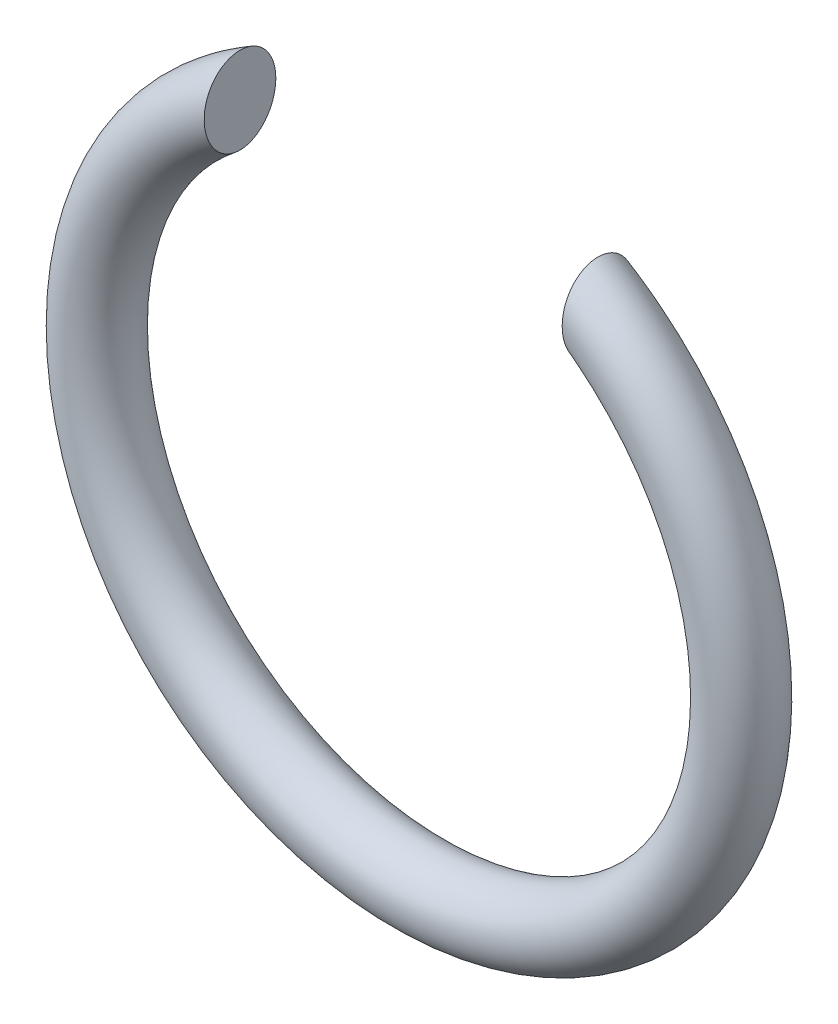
from build123d import *

# Parameters (mm, degrees)
SKETCH2_R               = 0.4
CUT_EXTRUDE1_DEPTH      = 6.6709789
CUT_EXTRUDE1_DEPTH_BACK = 6.6709789
SKETCH3_W               = 4
SKETCH3_H               = 4


with BuildPart() as part:
    # Base-Sweep: sweep along a path in Sketch1
    with BuildLine(Plane.XY) as base_sweep_path:
        CenterArc((0, 0), 3.6, 0, 360)
    # Sketch2 → Base-Sweep (sweep)
    with BuildSketch(Plane(origin=(0, 0, 0), x_dir=(1, 0, 0), z_dir=(0, 1, 0))):
        with Locations((3.6, 0)):
            Circle(SKETCH2_R)
    sweep(path=base_sweep_path.line)

    # Sketch3 → Cut-Extrude1 (cut, two sides: drawn at the far end of the back side and taken through both)
    with BuildSketch(Plane.XY.offset(-CUT_EXTRUDE1_DEPTH_BACK)):
        with Locations((0, 2)):
            Rectangle(SKETCH3_W, SKETCH3_H)
    extrude(amount=CUT_EXTRUDE1_DEPTH + CUT_EXTRUDE1_DEPTH_BACK, mode=Mode.SUBTRACT)


solid = part.part
